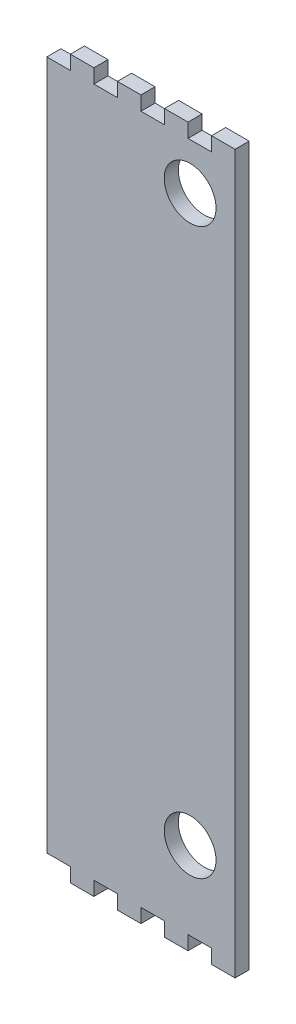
ISO-10303-21;
HEADER;
FILE_DESCRIPTION(('STEP AP214'),'2;1');
FILE_NAME('part.step','',(''),(''),'','','');
FILE_SCHEMA(('AUTOMOTIVE_DESIGN { 1 0 10303 214 1 1 1 1 }'));
ENDSEC;
DATA;
#1=APPLICATION_CONTEXT('core data for automotive mechanical design processes');
#2=APPLICATION_PROTOCOL_DEFINITION('international standard','automotive_design',2000,#1);
#3=PRODUCT_CONTEXT('',#1,'mechanical');
#4=PRODUCT('Part','Part','',(#3));
#5=PRODUCT_RELATED_PRODUCT_CATEGORY('part','',(#4));
#6=PRODUCT_DEFINITION_FORMATION('','',#4);
#7=PRODUCT_DEFINITION_CONTEXT('part definition',#1,'design');
#8=PRODUCT_DEFINITION('design','',#6,#7);
#9=PRODUCT_DEFINITION_SHAPE('','',#8);
#10=(LENGTH_UNIT() NAMED_UNIT(*) SI_UNIT(.MILLI.,.METRE.));
#11=(NAMED_UNIT(*) PLANE_ANGLE_UNIT() SI_UNIT($,.RADIAN.));
#12=(NAMED_UNIT(*) SI_UNIT($,.STERADIAN.) SOLID_ANGLE_UNIT());
#13=UNCERTAINTY_MEASURE_WITH_UNIT(LENGTH_MEASURE(1.E-05),#10,'distance_accuracy_value','');
#14=(GEOMETRIC_REPRESENTATION_CONTEXT(3) GLOBAL_UNCERTAINTY_ASSIGNED_CONTEXT((#13)) GLOBAL_UNIT_ASSIGNED_CONTEXT((#10,
#11,#12)) REPRESENTATION_CONTEXT('',''));
#15=CARTESIAN_POINT('',(0.,0.,0.));
#16=DIRECTION('',(0.,0.,1.));
#17=DIRECTION('',(1.,0.,0.));
#18=AXIS2_PLACEMENT_3D('',#15,#16,#17);
#19=CARTESIAN_POINT('',(-30.,143.,6.));
#20=DIRECTION('',(0.,-1.,0.));
#21=DIRECTION('',(0.,0.,-1.));
#22=AXIS2_PLACEMENT_3D('',#19,#20,#21);
#23=PLANE('',#22);
#24=DIRECTION('',(-1.,0.,0.));
#25=VECTOR('',#24,1.);
#26=CARTESIAN_POINT('',(-30.,143.,0.));
#27=LINE('',#26,#25);
#28=CARTESIAN_POINT('',(-30.,143.,0.));
#29=VERTEX_POINT('',#28);
#30=CARTESIAN_POINT('',(-40.0000000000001,143.,0.));
#31=VERTEX_POINT('',#30);
#32=EDGE_CURVE('E272',#29,#31,#27,.T.);
#33=ORIENTED_EDGE('',*,*,#32,.T.);
#34=DIRECTION('',(0.,0.,-1.));
#35=VECTOR('',#34,1.);
#36=CARTESIAN_POINT('',(-40.0000000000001,143.,6.));
#37=LINE('',#36,#35);
#38=CARTESIAN_POINT('',(-40.0000000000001,143.,6.));
#39=VERTEX_POINT('',#38);
#40=EDGE_CURVE('E11',#39,#31,#37,.T.);
#41=ORIENTED_EDGE('',*,*,#40,.F.);
#42=DIRECTION('',(-1.,0.,0.));
#43=VECTOR('',#42,1.);
#44=CARTESIAN_POINT('',(-30.,143.,6.));
#45=LINE('',#44,#43);
#46=CARTESIAN_POINT('',(-30.,143.,6.));
#47=VERTEX_POINT('',#46);
#48=EDGE_CURVE('E335',#47,#39,#45,.T.);
#49=ORIENTED_EDGE('',*,*,#48,.F.);
#50=DIRECTION('',(0.,0.,-1.));
#51=VECTOR('',#50,1.);
#52=CARTESIAN_POINT('',(-30.,143.,6.));
#53=LINE('',#52,#51);
#54=EDGE_CURVE('E268',#47,#29,#53,.T.);
#55=ORIENTED_EDGE('',*,*,#54,.T.);
#56=EDGE_LOOP('',(#33,#41,#49,#55));
#57=FACE_BOUND('',#56,.T.);
#58=ADVANCED_FACE('F32',(#57),#23,.F.);
#59=CARTESIAN_POINT('',(-40.0000000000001,143.,6.));
#60=DIRECTION('',(1.,0.,0.));
#61=DIRECTION('',(0.,1.,0.));
#62=AXIS2_PLACEMENT_3D('',#59,#60,#61);
#63=PLANE('',#62);
#64=DIRECTION('',(0.,-1.,0.));
#65=VECTOR('',#64,1.);
#66=CARTESIAN_POINT('',(-40.0000000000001,143.,0.));
#67=LINE('',#66,#65);
#68=CARTESIAN_POINT('',(-40.,-150.,0.));
#69=VERTEX_POINT('',#68);
#70=EDGE_CURVE('E275',#31,#69,#67,.T.);
#71=ORIENTED_EDGE('',*,*,#70,.T.);
#72=DIRECTION('',(0.,0.,-1.));
#73=VECTOR('',#72,1.);
#74=CARTESIAN_POINT('',(-40.,-150.,6.));
#75=LINE('',#74,#73);
#76=CARTESIAN_POINT('',(-40.,-150.,6.));
#77=VERTEX_POINT('',#76);
#78=EDGE_CURVE('E40',#77,#69,#75,.T.);
#79=ORIENTED_EDGE('',*,*,#78,.F.);
#80=DIRECTION('',(0.,-1.,0.));
#81=VECTOR('',#80,1.);
#82=CARTESIAN_POINT('',(-40.0000000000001,143.,6.));
#83=LINE('',#82,#81);
#84=EDGE_CURVE('E163',#39,#77,#83,.T.);
#85=ORIENTED_EDGE('',*,*,#84,.F.);
#86=ORIENTED_EDGE('',*,*,#40,.T.);
#87=EDGE_LOOP('',(#71,#79,#85,#86));
#88=FACE_BOUND('',#87,.T.);
#89=ADVANCED_FACE('F514',(#88),#63,.F.);
#90=CARTESIAN_POINT('',(-29.9999999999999,-150.,6.));
#91=DIRECTION('',(0.,1.,0.));
#92=DIRECTION('',(0.,0.,1.));
#93=AXIS2_PLACEMENT_3D('',#90,#91,#92);
#94=PLANE('',#93);
#95=DIRECTION('',(1.,0.,0.));
#96=VECTOR('',#95,1.);
#97=CARTESIAN_POINT('',(-29.9999999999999,-150.,0.));
#98=LINE('',#97,#96);
#99=CARTESIAN_POINT('',(-29.9999999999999,-150.,0.));
#100=VERTEX_POINT('',#99);
#101=EDGE_CURVE('E278',#69,#100,#98,.T.);
#102=ORIENTED_EDGE('',*,*,#101,.T.);
#103=DIRECTION('',(0.,0.,-1.));
#104=VECTOR('',#103,1.);
#105=CARTESIAN_POINT('',(-29.9999999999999,-150.,6.));
#106=LINE('',#105,#104);
#107=CARTESIAN_POINT('',(-29.9999999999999,-150.,6.));
#108=VERTEX_POINT('',#107);
#109=EDGE_CURVE('E414',#108,#100,#106,.T.);
#110=ORIENTED_EDGE('',*,*,#109,.F.);
#111=DIRECTION('',(1.,0.,0.));
#112=VECTOR('',#111,1.);
#113=CARTESIAN_POINT('',(-29.9999999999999,-150.,6.));
#114=LINE('',#113,#112);
#115=EDGE_CURVE('E422',#77,#108,#114,.T.);
#116=ORIENTED_EDGE('',*,*,#115,.F.);
#117=ORIENTED_EDGE('',*,*,#78,.T.);
#118=EDGE_LOOP('',(#102,#110,#116,#117));
#119=FACE_BOUND('',#118,.T.);
#120=ADVANCED_FACE('F420',(#119),#94,.F.);
#121=CARTESIAN_POINT('',(-29.9999999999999,-156.,6.));
#122=DIRECTION('',(1.,0.,0.));
#123=DIRECTION('',(0.,0.,-1.));
#124=AXIS2_PLACEMENT_3D('',#121,#122,#123);
#125=PLANE('',#124);
#126=DIRECTION('',(0.,-1.,0.));
#127=VECTOR('',#126,1.);
#128=CARTESIAN_POINT('',(-29.9999999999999,-156.,0.));
#129=LINE('',#128,#127);
#130=CARTESIAN_POINT('',(-29.9999999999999,-156.,0.));
#131=VERTEX_POINT('',#130);
#132=EDGE_CURVE('E280',#100,#131,#129,.T.);
#133=ORIENTED_EDGE('',*,*,#132,.T.);
#134=DIRECTION('',(0.,0.,-1.));
#135=VECTOR('',#134,1.);
#136=CARTESIAN_POINT('',(-29.9999999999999,-156.,6.));
#137=LINE('',#136,#135);
#138=CARTESIAN_POINT('',(-29.9999999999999,-156.,6.));
#139=VERTEX_POINT('',#138);
#140=EDGE_CURVE('E411',#139,#131,#137,.T.);
#141=ORIENTED_EDGE('',*,*,#140,.F.);
#142=DIRECTION('',(0.,-1.,0.));
#143=VECTOR('',#142,1.);
#144=CARTESIAN_POINT('',(-29.9999999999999,-156.,6.));
#145=LINE('',#144,#143);
#146=EDGE_CURVE('E440',#108,#139,#145,.T.);
#147=ORIENTED_EDGE('',*,*,#146,.F.);
#148=ORIENTED_EDGE('',*,*,#109,.T.);
#149=EDGE_LOOP('',(#133,#141,#147,#148));
#150=FACE_BOUND('',#149,.T.);
#151=ADVANCED_FACE('F431',(#150),#125,.F.);
#152=CARTESIAN_POINT('',(-19.9999999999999,-156.,6.));
#153=DIRECTION('',(0.,1.,0.));
#154=DIRECTION('',(0.,0.,1.));
#155=AXIS2_PLACEMENT_3D('',#152,#153,#154);
#156=PLANE('',#155);
#157=DIRECTION('',(1.,0.,0.));
#158=VECTOR('',#157,1.);
#159=CARTESIAN_POINT('',(-19.9999999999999,-156.,0.));
#160=LINE('',#159,#158);
#161=CARTESIAN_POINT('',(-19.9999999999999,-156.,0.));
#162=VERTEX_POINT('',#161);
#163=EDGE_CURVE('E282',#131,#162,#160,.T.);
#164=ORIENTED_EDGE('',*,*,#163,.T.);
#165=DIRECTION('',(0.,0.,-1.));
#166=VECTOR('',#165,1.);
#167=CARTESIAN_POINT('',(-19.9999999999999,-156.,6.));
#168=LINE('',#167,#166);
#169=CARTESIAN_POINT('',(-19.9999999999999,-156.,6.));
#170=VERTEX_POINT('',#169);
#171=EDGE_CURVE('E408',#170,#162,#168,.T.);
#172=ORIENTED_EDGE('',*,*,#171,.F.);
#173=DIRECTION('',(1.,0.,0.));
#174=VECTOR('',#173,1.);
#175=CARTESIAN_POINT('',(-19.9999999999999,-156.,6.));
#176=LINE('',#175,#174);
#177=EDGE_CURVE('E437',#139,#170,#176,.T.);
#178=ORIENTED_EDGE('',*,*,#177,.F.);
#179=ORIENTED_EDGE('',*,*,#140,.T.);
#180=EDGE_LOOP('',(#164,#172,#178,#179));
#181=FACE_BOUND('',#180,.T.);
#182=ADVANCED_FACE('F435',(#181),#156,.F.);
#183=CARTESIAN_POINT('',(-19.9999999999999,-156.,6.));
#184=DIRECTION('',(-1.,0.,0.));
#185=DIRECTION('',(0.,-1.,0.));
#186=AXIS2_PLACEMENT_3D('',#183,#184,#185);
#187=PLANE('',#186);
#188=DIRECTION('',(0.,1.,0.));
#189=VECTOR('',#188,1.);
#190=CARTESIAN_POINT('',(-19.9999999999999,-156.,0.));
#191=LINE('',#190,#189);
#192=CARTESIAN_POINT('',(-20.,-150.,0.));
#193=VERTEX_POINT('',#192);
#194=EDGE_CURVE('E284',#162,#193,#191,.T.);
#195=ORIENTED_EDGE('',*,*,#194,.T.);
#196=DIRECTION('',(0.,0.,-1.));
#197=VECTOR('',#196,1.);
#198=CARTESIAN_POINT('',(-20.,-150.,6.));
#199=LINE('',#198,#197);
#200=CARTESIAN_POINT('',(-20.,-150.,6.));
#201=VERTEX_POINT('',#200);
#202=EDGE_CURVE('E405',#201,#193,#199,.T.);
#203=ORIENTED_EDGE('',*,*,#202,.F.);
#204=DIRECTION('',(0.,1.,0.));
#205=VECTOR('',#204,1.);
#206=CARTESIAN_POINT('',(-19.9999999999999,-156.,6.));
#207=LINE('',#206,#205);
#208=EDGE_CURVE('E439',#170,#201,#207,.T.);
#209=ORIENTED_EDGE('',*,*,#208,.F.);
#210=ORIENTED_EDGE('',*,*,#171,.T.);
#211=EDGE_LOOP('',(#195,#203,#209,#210));
#212=FACE_BOUND('',#211,.T.);
#213=ADVANCED_FACE('F527',(#212),#187,.F.);
#214=CARTESIAN_POINT('',(-9.9999999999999,-150.,6.));
#215=DIRECTION('',(0.,1.,0.));
#216=DIRECTION('',(0.,0.,1.));
#217=AXIS2_PLACEMENT_3D('',#214,#215,#216);
#218=PLANE('',#217);
#219=DIRECTION('',(1.,0.,0.));
#220=VECTOR('',#219,1.);
#221=CARTESIAN_POINT('',(-9.9999999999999,-150.,0.));
#222=LINE('',#221,#220);
#223=CARTESIAN_POINT('',(-9.9999999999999,-150.,0.));
#224=VERTEX_POINT('',#223);
#225=EDGE_CURVE('E286',#193,#224,#222,.T.);
#226=ORIENTED_EDGE('',*,*,#225,.T.);
#227=DIRECTION('',(0.,0.,-1.));
#228=VECTOR('',#227,1.);
#229=CARTESIAN_POINT('',(-9.9999999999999,-150.,6.));
#230=LINE('',#229,#228);
#231=CARTESIAN_POINT('',(-9.9999999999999,-150.,6.));
#232=VERTEX_POINT('',#231);
#233=EDGE_CURVE('E402',#232,#224,#230,.T.);
#234=ORIENTED_EDGE('',*,*,#233,.F.);
#235=DIRECTION('',(1.,0.,0.));
#236=VECTOR('',#235,1.);
#237=CARTESIAN_POINT('',(-9.9999999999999,-150.,6.));
#238=LINE('',#237,#236);
#239=EDGE_CURVE('E442',#201,#232,#238,.T.);
#240=ORIENTED_EDGE('',*,*,#239,.F.);
#241=ORIENTED_EDGE('',*,*,#202,.T.);
#242=EDGE_LOOP('',(#226,#234,#240,#241));
#243=FACE_BOUND('',#242,.T.);
#244=ADVANCED_FACE('F530',(#243),#218,.F.);
#245=CARTESIAN_POINT('',(-9.9999999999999,-156.,6.));
#246=DIRECTION('',(1.,0.,0.));
#247=DIRECTION('',(0.,0.,-1.));
#248=AXIS2_PLACEMENT_3D('',#245,#246,#247);
#249=PLANE('',#248);
#250=DIRECTION('',(0.,-1.,0.));
#251=VECTOR('',#250,1.);
#252=CARTESIAN_POINT('',(-9.9999999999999,-156.,0.));
#253=LINE('',#252,#251);
#254=CARTESIAN_POINT('',(-9.9999999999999,-156.,0.));
#255=VERTEX_POINT('',#254);
#256=EDGE_CURVE('E288',#224,#255,#253,.T.);
#257=ORIENTED_EDGE('',*,*,#256,.T.);
#258=DIRECTION('',(0.,0.,-1.));
#259=VECTOR('',#258,1.);
#260=CARTESIAN_POINT('',(-9.9999999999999,-156.,6.));
#261=LINE('',#260,#259);
#262=CARTESIAN_POINT('',(-9.9999999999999,-156.,6.));
#263=VERTEX_POINT('',#262);
#264=EDGE_CURVE('E399',#263,#255,#261,.T.);
#265=ORIENTED_EDGE('',*,*,#264,.F.);
#266=DIRECTION('',(0.,-1.,0.));
#267=VECTOR('',#266,1.);
#268=CARTESIAN_POINT('',(-9.9999999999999,-156.,6.));
#269=LINE('',#268,#267);
#270=EDGE_CURVE('E448',#232,#263,#269,.T.);
#271=ORIENTED_EDGE('',*,*,#270,.F.);
#272=ORIENTED_EDGE('',*,*,#233,.T.);
#273=EDGE_LOOP('',(#257,#265,#271,#272));
#274=FACE_BOUND('',#273,.T.);
#275=ADVANCED_FACE('F534',(#274),#249,.F.);
#276=CARTESIAN_POINT('',(0.,-156.,6.));
#277=DIRECTION('',(0.,1.,0.));
#278=DIRECTION('',(0.,0.,1.));
#279=AXIS2_PLACEMENT_3D('',#276,#277,#278);
#280=PLANE('',#279);
#281=DIRECTION('',(1.,0.,0.));
#282=VECTOR('',#281,1.);
#283=CARTESIAN_POINT('',(0.,-156.,0.));
#284=LINE('',#283,#282);
#285=CARTESIAN_POINT('',(0.,-156.,0.));
#286=VERTEX_POINT('',#285);
#287=EDGE_CURVE('E290',#255,#286,#284,.T.);
#288=ORIENTED_EDGE('',*,*,#287,.T.);
#289=DIRECTION('',(0.,0.,-1.));
#290=VECTOR('',#289,1.);
#291=CARTESIAN_POINT('',(0.,-156.,6.));
#292=LINE('',#291,#290);
#293=CARTESIAN_POINT('',(0.,-156.,6.));
#294=VERTEX_POINT('',#293);
#295=EDGE_CURVE('E396',#294,#286,#292,.T.);
#296=ORIENTED_EDGE('',*,*,#295,.F.);
#297=DIRECTION('',(1.,0.,0.));
#298=VECTOR('',#297,1.);
#299=CARTESIAN_POINT('',(0.,-156.,6.));
#300=LINE('',#299,#298);
#301=EDGE_CURVE('E450',#263,#294,#300,.T.);
#302=ORIENTED_EDGE('',*,*,#301,.F.);
#303=ORIENTED_EDGE('',*,*,#264,.T.);
#304=EDGE_LOOP('',(#288,#296,#302,#303));
#305=FACE_BOUND('',#304,.T.);
#306=ADVANCED_FACE('F538',(#305),#280,.F.);
#307=CARTESIAN_POINT('',(0.,-156.,6.));
#308=DIRECTION('',(-1.,0.,0.));
#309=DIRECTION('',(0.,-1.,0.));
#310=AXIS2_PLACEMENT_3D('',#307,#308,#309);
#311=PLANE('',#310);
#312=DIRECTION('',(0.,1.,0.));
#313=VECTOR('',#312,1.);
#314=CARTESIAN_POINT('',(0.,-156.,0.));
#315=LINE('',#314,#313);
#316=CARTESIAN_POINT('',(0.,-150.,0.));
#317=VERTEX_POINT('',#316);
#318=EDGE_CURVE('E292',#286,#317,#315,.T.);
#319=ORIENTED_EDGE('',*,*,#318,.T.);
#320=DIRECTION('',(0.,0.,-1.));
#321=VECTOR('',#320,1.);
#322=CARTESIAN_POINT('',(0.,-150.,6.));
#323=LINE('',#322,#321);
#324=CARTESIAN_POINT('',(0.,-150.,6.));
#325=VERTEX_POINT('',#324);
#326=EDGE_CURVE('E393',#325,#317,#323,.T.);
#327=ORIENTED_EDGE('',*,*,#326,.F.);
#328=DIRECTION('',(0.,1.,0.));
#329=VECTOR('',#328,1.);
#330=CARTESIAN_POINT('',(0.,-156.,6.));
#331=LINE('',#330,#329);
#332=EDGE_CURVE('E452',#294,#325,#331,.T.);
#333=ORIENTED_EDGE('',*,*,#332,.F.);
#334=ORIENTED_EDGE('',*,*,#295,.T.);
#335=EDGE_LOOP('',(#319,#327,#333,#334));
#336=FACE_BOUND('',#335,.T.);
#337=ADVANCED_FACE('F542',(#336),#311,.F.);
#338=CARTESIAN_POINT('',(10.0000000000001,-150.,6.));
#339=DIRECTION('',(0.,1.,0.));
#340=DIRECTION('',(0.,0.,1.));
#341=AXIS2_PLACEMENT_3D('',#338,#339,#340);
#342=PLANE('',#341);
#343=DIRECTION('',(1.,0.,0.));
#344=VECTOR('',#343,1.);
#345=CARTESIAN_POINT('',(10.0000000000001,-150.,0.));
#346=LINE('',#345,#344);
#347=CARTESIAN_POINT('',(10.0000000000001,-150.,0.));
#348=VERTEX_POINT('',#347);
#349=EDGE_CURVE('E294',#317,#348,#346,.T.);
#350=ORIENTED_EDGE('',*,*,#349,.T.);
#351=DIRECTION('',(0.,0.,-1.));
#352=VECTOR('',#351,1.);
#353=CARTESIAN_POINT('',(10.0000000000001,-150.,6.));
#354=LINE('',#353,#352);
#355=CARTESIAN_POINT('',(10.0000000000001,-150.,6.));
#356=VERTEX_POINT('',#355);
#357=EDGE_CURVE('E390',#356,#348,#354,.T.);
#358=ORIENTED_EDGE('',*,*,#357,.F.);
#359=DIRECTION('',(1.,0.,0.));
#360=VECTOR('',#359,1.);
#361=CARTESIAN_POINT('',(10.0000000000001,-150.,6.));
#362=LINE('',#361,#360);
#363=EDGE_CURVE('E454',#325,#356,#362,.T.);
#364=ORIENTED_EDGE('',*,*,#363,.F.);
#365=ORIENTED_EDGE('',*,*,#326,.T.);
#366=EDGE_LOOP('',(#350,#358,#364,#365));
#367=FACE_BOUND('',#366,.T.);
#368=ADVANCED_FACE('F546',(#367),#342,.F.);
#369=CARTESIAN_POINT('',(10.0000000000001,-156.,6.));
#370=DIRECTION('',(1.,0.,0.));
#371=DIRECTION('',(0.,0.,-1.));
#372=AXIS2_PLACEMENT_3D('',#369,#370,#371);
#373=PLANE('',#372);
#374=DIRECTION('',(0.,-1.,0.));
#375=VECTOR('',#374,1.);
#376=CARTESIAN_POINT('',(10.0000000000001,-156.,0.));
#377=LINE('',#376,#375);
#378=CARTESIAN_POINT('',(10.0000000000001,-156.,0.));
#379=VERTEX_POINT('',#378);
#380=EDGE_CURVE('E296',#348,#379,#377,.T.);
#381=ORIENTED_EDGE('',*,*,#380,.T.);
#382=DIRECTION('',(0.,0.,-1.));
#383=VECTOR('',#382,1.);
#384=CARTESIAN_POINT('',(10.0000000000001,-156.,6.));
#385=LINE('',#384,#383);
#386=CARTESIAN_POINT('',(10.0000000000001,-156.,6.));
#387=VERTEX_POINT('',#386);
#388=EDGE_CURVE('E387',#387,#379,#385,.T.);
#389=ORIENTED_EDGE('',*,*,#388,.F.);
#390=DIRECTION('',(0.,-1.,0.));
#391=VECTOR('',#390,1.);
#392=CARTESIAN_POINT('',(10.0000000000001,-156.,6.));
#393=LINE('',#392,#391);
#394=EDGE_CURVE('E456',#356,#387,#393,.T.);
#395=ORIENTED_EDGE('',*,*,#394,.F.);
#396=ORIENTED_EDGE('',*,*,#357,.T.);
#397=EDGE_LOOP('',(#381,#389,#395,#396));
#398=FACE_BOUND('',#397,.T.);
#399=ADVANCED_FACE('F550',(#398),#373,.F.);
#400=CARTESIAN_POINT('',(20.0000000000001,-156.,6.));
#401=DIRECTION('',(0.,1.,0.));
#402=DIRECTION('',(0.,0.,1.));
#403=AXIS2_PLACEMENT_3D('',#400,#401,#402);
#404=PLANE('',#403);
#405=DIRECTION('',(1.,0.,0.));
#406=VECTOR('',#405,1.);
#407=CARTESIAN_POINT('',(20.0000000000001,-156.,0.));
#408=LINE('',#407,#406);
#409=CARTESIAN_POINT('',(20.0000000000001,-156.,0.));
#410=VERTEX_POINT('',#409);
#411=EDGE_CURVE('E298',#379,#410,#408,.T.);
#412=ORIENTED_EDGE('',*,*,#411,.T.);
#413=DIRECTION('',(0.,0.,-1.));
#414=VECTOR('',#413,1.);
#415=CARTESIAN_POINT('',(20.0000000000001,-156.,6.));
#416=LINE('',#415,#414);
#417=CARTESIAN_POINT('',(20.0000000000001,-156.,6.));
#418=VERTEX_POINT('',#417);
#419=EDGE_CURVE('E384',#418,#410,#416,.T.);
#420=ORIENTED_EDGE('',*,*,#419,.F.);
#421=DIRECTION('',(1.,0.,0.));
#422=VECTOR('',#421,1.);
#423=CARTESIAN_POINT('',(20.0000000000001,-156.,6.));
#424=LINE('',#423,#422);
#425=EDGE_CURVE('E458',#387,#418,#424,.T.);
#426=ORIENTED_EDGE('',*,*,#425,.F.);
#427=ORIENTED_EDGE('',*,*,#388,.T.);
#428=EDGE_LOOP('',(#412,#420,#426,#427));
#429=FACE_BOUND('',#428,.T.);
#430=ADVANCED_FACE('F554',(#429),#404,.F.);
#431=CARTESIAN_POINT('',(20.0000000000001,-156.,6.));
#432=DIRECTION('',(-1.,0.,0.));
#433=DIRECTION('',(0.,-1.,0.));
#434=AXIS2_PLACEMENT_3D('',#431,#432,#433);
#435=PLANE('',#434);
#436=DIRECTION('',(0.,1.,0.));
#437=VECTOR('',#436,1.);
#438=CARTESIAN_POINT('',(20.0000000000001,-156.,0.));
#439=LINE('',#438,#437);
#440=CARTESIAN_POINT('',(20.,-150.,0.));
#441=VERTEX_POINT('',#440);
#442=EDGE_CURVE('E300',#410,#441,#439,.T.);
#443=ORIENTED_EDGE('',*,*,#442,.T.);
#444=DIRECTION('',(0.,0.,-1.));
#445=VECTOR('',#444,1.);
#446=CARTESIAN_POINT('',(20.,-150.,6.));
#447=LINE('',#446,#445);
#448=CARTESIAN_POINT('',(20.,-150.,6.));
#449=VERTEX_POINT('',#448);
#450=EDGE_CURVE('E381',#449,#441,#447,.T.);
#451=ORIENTED_EDGE('',*,*,#450,.F.);
#452=DIRECTION('',(0.,1.,0.));
#453=VECTOR('',#452,1.);
#454=CARTESIAN_POINT('',(20.0000000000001,-156.,6.));
#455=LINE('',#454,#453);
#456=EDGE_CURVE('E460',#418,#449,#455,.T.);
#457=ORIENTED_EDGE('',*,*,#456,.F.);
#458=ORIENTED_EDGE('',*,*,#419,.T.);
#459=EDGE_LOOP('',(#443,#451,#457,#458));
#460=FACE_BOUND('',#459,.T.);
#461=ADVANCED_FACE('F558',(#460),#435,.F.);
#462=CARTESIAN_POINT('',(30.0000000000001,-150.,6.));
#463=DIRECTION('',(0.,1.,0.));
#464=DIRECTION('',(0.,0.,1.));
#465=AXIS2_PLACEMENT_3D('',#462,#463,#464);
#466=PLANE('',#465);
#467=DIRECTION('',(1.,0.,0.));
#468=VECTOR('',#467,1.);
#469=CARTESIAN_POINT('',(30.0000000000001,-150.,0.));
#470=LINE('',#469,#468);
#471=CARTESIAN_POINT('',(30.0000000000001,-150.,0.));
#472=VERTEX_POINT('',#471);
#473=EDGE_CURVE('E302',#441,#472,#470,.T.);
#474=ORIENTED_EDGE('',*,*,#473,.T.);
#475=DIRECTION('',(0.,0.,-1.));
#476=VECTOR('',#475,1.);
#477=CARTESIAN_POINT('',(30.0000000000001,-150.,6.));
#478=LINE('',#477,#476);
#479=CARTESIAN_POINT('',(30.0000000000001,-150.,6.));
#480=VERTEX_POINT('',#479);
#481=EDGE_CURVE('E378',#480,#472,#478,.T.);
#482=ORIENTED_EDGE('',*,*,#481,.F.);
#483=DIRECTION('',(1.,0.,0.));
#484=VECTOR('',#483,1.);
#485=CARTESIAN_POINT('',(30.0000000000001,-150.,6.));
#486=LINE('',#485,#484);
#487=EDGE_CURVE('E462',#449,#480,#486,.T.);
#488=ORIENTED_EDGE('',*,*,#487,.F.);
#489=ORIENTED_EDGE('',*,*,#450,.T.);
#490=EDGE_LOOP('',(#474,#482,#488,#489));
#491=FACE_BOUND('',#490,.T.);
#492=ADVANCED_FACE('F562',(#491),#466,.F.);
#493=CARTESIAN_POINT('',(30.0000000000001,-156.,6.));
#494=DIRECTION('',(1.,0.,0.));
#495=DIRECTION('',(0.,0.,-1.));
#496=AXIS2_PLACEMENT_3D('',#493,#494,#495);
#497=PLANE('',#496);
#498=DIRECTION('',(0.,-1.,0.));
#499=VECTOR('',#498,1.);
#500=CARTESIAN_POINT('',(30.0000000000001,-156.,0.));
#501=LINE('',#500,#499);
#502=CARTESIAN_POINT('',(30.0000000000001,-156.,0.));
#503=VERTEX_POINT('',#502);
#504=EDGE_CURVE('E304',#472,#503,#501,.T.);
#505=ORIENTED_EDGE('',*,*,#504,.T.);
#506=DIRECTION('',(0.,0.,-1.));
#507=VECTOR('',#506,1.);
#508=CARTESIAN_POINT('',(30.0000000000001,-156.,6.));
#509=LINE('',#508,#507);
#510=CARTESIAN_POINT('',(30.0000000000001,-156.,6.));
#511=VERTEX_POINT('',#510);
#512=EDGE_CURVE('E375',#511,#503,#509,.T.);
#513=ORIENTED_EDGE('',*,*,#512,.F.);
#514=DIRECTION('',(0.,-1.,0.));
#515=VECTOR('',#514,1.);
#516=CARTESIAN_POINT('',(30.0000000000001,-156.,6.));
#517=LINE('',#516,#515);
#518=EDGE_CURVE('E464',#480,#511,#517,.T.);
#519=ORIENTED_EDGE('',*,*,#518,.F.);
#520=ORIENTED_EDGE('',*,*,#481,.T.);
#521=EDGE_LOOP('',(#505,#513,#519,#520));
#522=FACE_BOUND('',#521,.T.);
#523=ADVANCED_FACE('F566',(#522),#497,.F.);
#524=CARTESIAN_POINT('',(40.0000000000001,-156.,6.));
#525=DIRECTION('',(0.,1.,0.));
#526=DIRECTION('',(0.,0.,1.));
#527=AXIS2_PLACEMENT_3D('',#524,#525,#526);
#528=PLANE('',#527);
#529=DIRECTION('',(1.,0.,0.));
#530=VECTOR('',#529,1.);
#531=CARTESIAN_POINT('',(40.0000000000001,-156.,0.));
#532=LINE('',#531,#530);
#533=CARTESIAN_POINT('',(40.0000000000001,-156.,0.));
#534=VERTEX_POINT('',#533);
#535=EDGE_CURVE('E306',#503,#534,#532,.T.);
#536=ORIENTED_EDGE('',*,*,#535,.T.);
#537=DIRECTION('',(0.,0.,-1.));
#538=VECTOR('',#537,1.);
#539=CARTESIAN_POINT('',(40.0000000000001,-156.,6.));
#540=LINE('',#539,#538);
#541=CARTESIAN_POINT('',(40.0000000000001,-156.,6.));
#542=VERTEX_POINT('',#541);
#543=EDGE_CURVE('E372',#542,#534,#540,.T.);
#544=ORIENTED_EDGE('',*,*,#543,.F.);
#545=DIRECTION('',(1.,0.,0.));
#546=VECTOR('',#545,1.);
#547=CARTESIAN_POINT('',(40.0000000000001,-156.,6.));
#548=LINE('',#547,#546);
#549=EDGE_CURVE('E466',#511,#542,#548,.T.);
#550=ORIENTED_EDGE('',*,*,#549,.F.);
#551=ORIENTED_EDGE('',*,*,#512,.T.);
#552=EDGE_LOOP('',(#536,#544,#550,#551));
#553=FACE_BOUND('',#552,.T.);
#554=ADVANCED_FACE('F570',(#553),#528,.F.);
#555=CARTESIAN_POINT('',(40.0000000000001,149.,6.));
#556=DIRECTION('',(-1.,0.,0.));
#557=DIRECTION('',(0.,0.,1.));
#558=AXIS2_PLACEMENT_3D('',#555,#556,#557);
#559=PLANE('',#558);
#560=DIRECTION('',(0.,1.,0.));
#561=VECTOR('',#560,1.);
#562=CARTESIAN_POINT('',(40.0000000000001,149.,0.));
#563=LINE('',#562,#561);
#564=CARTESIAN_POINT('',(40.0000000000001,149.,0.));
#565=VERTEX_POINT('',#564);
#566=EDGE_CURVE('E308',#534,#565,#563,.T.);
#567=ORIENTED_EDGE('',*,*,#566,.T.);
#568=DIRECTION('',(0.,0.,-1.));
#569=VECTOR('',#568,1.);
#570=CARTESIAN_POINT('',(40.0000000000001,149.,6.));
#571=LINE('',#570,#569);
#572=CARTESIAN_POINT('',(40.0000000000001,149.,6.));
#573=VERTEX_POINT('',#572);
#574=EDGE_CURVE('E369',#573,#565,#571,.T.);
#575=ORIENTED_EDGE('',*,*,#574,.F.);
#576=DIRECTION('',(0.,1.,0.));
#577=VECTOR('',#576,1.);
#578=CARTESIAN_POINT('',(40.0000000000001,149.,6.));
#579=LINE('',#578,#577);
#580=EDGE_CURVE('E468',#542,#573,#579,.T.);
#581=ORIENTED_EDGE('',*,*,#580,.F.);
#582=ORIENTED_EDGE('',*,*,#543,.T.);
#583=EDGE_LOOP('',(#567,#575,#581,#582));
#584=FACE_BOUND('',#583,.T.);
#585=ADVANCED_FACE('F574',(#584),#559,.F.);
#586=CARTESIAN_POINT('',(40.0000000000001,149.,6.));
#587=DIRECTION('',(0.,-1.,0.));
#588=DIRECTION('',(0.,0.,-1.));
#589=AXIS2_PLACEMENT_3D('',#586,#587,#588);
#590=PLANE('',#589);
#591=DIRECTION('',(-1.,0.,0.));
#592=VECTOR('',#591,1.);
#593=CARTESIAN_POINT('',(40.0000000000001,149.,0.));
#594=LINE('',#593,#592);
#595=CARTESIAN_POINT('',(30.0000000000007,149.,0.));
#596=VERTEX_POINT('',#595);
#597=EDGE_CURVE('E310',#565,#596,#594,.T.);
#598=ORIENTED_EDGE('',*,*,#597,.T.);
#599=DIRECTION('',(0.,0.,-1.));
#600=VECTOR('',#599,1.);
#601=CARTESIAN_POINT('',(30.0000000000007,149.,6.));
#602=LINE('',#601,#600);
#603=CARTESIAN_POINT('',(30.0000000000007,149.,6.));
#604=VERTEX_POINT('',#603);
#605=EDGE_CURVE('E366',#604,#596,#602,.T.);
#606=ORIENTED_EDGE('',*,*,#605,.F.);
#607=DIRECTION('',(-1.,0.,0.));
#608=VECTOR('',#607,1.);
#609=CARTESIAN_POINT('',(40.0000000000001,149.,6.));
#610=LINE('',#609,#608);
#611=EDGE_CURVE('E470',#573,#604,#610,.T.);
#612=ORIENTED_EDGE('',*,*,#611,.F.);
#613=ORIENTED_EDGE('',*,*,#574,.T.);
#614=EDGE_LOOP('',(#598,#606,#612,#613));
#615=FACE_BOUND('',#614,.T.);
#616=ADVANCED_FACE('F578',(#615),#590,.F.);
#617=CARTESIAN_POINT('',(30.0000000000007,149.,6.));
#618=DIRECTION('',(1.,0.,0.));
#619=DIRECTION('',(0.,0.,-1.));
#620=AXIS2_PLACEMENT_3D('',#617,#618,#619);
#621=PLANE('',#620);
#622=DIRECTION('',(0.,-1.,0.));
#623=VECTOR('',#622,1.);
#624=CARTESIAN_POINT('',(30.0000000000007,149.,0.));
#625=LINE('',#624,#623);
#626=CARTESIAN_POINT('',(30.0000000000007,143.,0.));
#627=VERTEX_POINT('',#626);
#628=EDGE_CURVE('E312',#596,#627,#625,.T.);
#629=ORIENTED_EDGE('',*,*,#628,.T.);
#630=DIRECTION('',(0.,0.,-1.));
#631=VECTOR('',#630,1.);
#632=CARTESIAN_POINT('',(30.0000000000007,143.,6.));
#633=LINE('',#632,#631);
#634=CARTESIAN_POINT('',(30.0000000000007,143.,6.));
#635=VERTEX_POINT('',#634);
#636=EDGE_CURVE('E363',#635,#627,#633,.T.);
#637=ORIENTED_EDGE('',*,*,#636,.F.);
#638=DIRECTION('',(0.,-1.,0.));
#639=VECTOR('',#638,1.);
#640=CARTESIAN_POINT('',(30.0000000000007,149.,6.));
#641=LINE('',#640,#639);
#642=EDGE_CURVE('E472',#604,#635,#641,.T.);
#643=ORIENTED_EDGE('',*,*,#642,.F.);
#644=ORIENTED_EDGE('',*,*,#605,.T.);
#645=EDGE_LOOP('',(#629,#637,#643,#644));
#646=FACE_BOUND('',#645,.T.);
#647=ADVANCED_FACE('F582',(#646),#621,.F.);
#648=CARTESIAN_POINT('',(30.0000000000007,143.,6.));
#649=DIRECTION('',(0.,-1.,0.));
#650=DIRECTION('',(0.,0.,-1.));
#651=AXIS2_PLACEMENT_3D('',#648,#649,#650);
#652=PLANE('',#651);
#653=DIRECTION('',(-1.,0.,0.));
#654=VECTOR('',#653,1.);
#655=CARTESIAN_POINT('',(30.0000000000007,143.,0.));
#656=LINE('',#655,#654);
#657=CARTESIAN_POINT('',(20.0000000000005,143.,0.));
#658=VERTEX_POINT('',#657);
#659=EDGE_CURVE('E314',#627,#658,#656,.T.);
#660=ORIENTED_EDGE('',*,*,#659,.T.);
#661=DIRECTION('',(0.,0.,-1.));
#662=VECTOR('',#661,1.);
#663=CARTESIAN_POINT('',(20.0000000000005,143.,6.));
#664=LINE('',#663,#662);
#665=CARTESIAN_POINT('',(20.0000000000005,143.,6.));
#666=VERTEX_POINT('',#665);
#667=EDGE_CURVE('E360',#666,#658,#664,.T.);
#668=ORIENTED_EDGE('',*,*,#667,.F.);
#669=DIRECTION('',(-1.,0.,0.));
#670=VECTOR('',#669,1.);
#671=CARTESIAN_POINT('',(30.0000000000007,143.,6.));
#672=LINE('',#671,#670);
#673=EDGE_CURVE('E474',#635,#666,#672,.T.);
#674=ORIENTED_EDGE('',*,*,#673,.F.);
#675=ORIENTED_EDGE('',*,*,#636,.T.);
#676=EDGE_LOOP('',(#660,#668,#674,#675));
#677=FACE_BOUND('',#676,.T.);
#678=ADVANCED_FACE('F586',(#677),#652,.F.);
#679=CARTESIAN_POINT('',(20.0000000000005,149.,6.));
#680=DIRECTION('',(-1.,0.,0.));
#681=DIRECTION('',(0.,0.,1.));
#682=AXIS2_PLACEMENT_3D('',#679,#680,#681);
#683=PLANE('',#682);
#684=DIRECTION('',(0.,1.,0.));
#685=VECTOR('',#684,1.);
#686=CARTESIAN_POINT('',(20.0000000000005,149.,0.));
#687=LINE('',#686,#685);
#688=CARTESIAN_POINT('',(20.0000000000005,149.,0.));
#689=VERTEX_POINT('',#688);
#690=EDGE_CURVE('E316',#658,#689,#687,.T.);
#691=ORIENTED_EDGE('',*,*,#690,.T.);
#692=DIRECTION('',(0.,0.,-1.));
#693=VECTOR('',#692,1.);
#694=CARTESIAN_POINT('',(20.0000000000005,149.,6.));
#695=LINE('',#694,#693);
#696=CARTESIAN_POINT('',(20.0000000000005,149.,6.));
#697=VERTEX_POINT('',#696);
#698=EDGE_CURVE('E357',#697,#689,#695,.T.);
#699=ORIENTED_EDGE('',*,*,#698,.F.);
#700=DIRECTION('',(0.,1.,0.));
#701=VECTOR('',#700,1.);
#702=CARTESIAN_POINT('',(20.0000000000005,149.,6.));
#703=LINE('',#702,#701);
#704=EDGE_CURVE('E476',#666,#697,#703,.T.);
#705=ORIENTED_EDGE('',*,*,#704,.F.);
#706=ORIENTED_EDGE('',*,*,#667,.T.);
#707=EDGE_LOOP('',(#691,#699,#705,#706));
#708=FACE_BOUND('',#707,.T.);
#709=ADVANCED_FACE('F590',(#708),#683,.F.);
#710=CARTESIAN_POINT('',(20.0000000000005,149.,6.));
#711=DIRECTION('',(0.,-1.,0.));
#712=DIRECTION('',(0.,0.,-1.));
#713=AXIS2_PLACEMENT_3D('',#710,#711,#712);
#714=PLANE('',#713);
#715=DIRECTION('',(-1.,0.,0.));
#716=VECTOR('',#715,1.);
#717=CARTESIAN_POINT('',(20.0000000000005,149.,0.));
#718=LINE('',#717,#716);
#719=CARTESIAN_POINT('',(10.0000000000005,149.,0.));
#720=VERTEX_POINT('',#719);
#721=EDGE_CURVE('E318',#689,#720,#718,.T.);
#722=ORIENTED_EDGE('',*,*,#721,.T.);
#723=DIRECTION('',(0.,0.,-1.));
#724=VECTOR('',#723,1.);
#725=CARTESIAN_POINT('',(10.0000000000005,149.,6.));
#726=LINE('',#725,#724);
#727=CARTESIAN_POINT('',(10.0000000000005,149.,6.));
#728=VERTEX_POINT('',#727);
#729=EDGE_CURVE('E354',#728,#720,#726,.T.);
#730=ORIENTED_EDGE('',*,*,#729,.F.);
#731=DIRECTION('',(-1.,0.,0.));
#732=VECTOR('',#731,1.);
#733=CARTESIAN_POINT('',(20.0000000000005,149.,6.));
#734=LINE('',#733,#732);
#735=EDGE_CURVE('E478',#697,#728,#734,.T.);
#736=ORIENTED_EDGE('',*,*,#735,.F.);
#737=ORIENTED_EDGE('',*,*,#698,.T.);
#738=EDGE_LOOP('',(#722,#730,#736,#737));
#739=FACE_BOUND('',#738,.T.);
#740=ADVANCED_FACE('F594',(#739),#714,.F.);
#741=CARTESIAN_POINT('',(10.0000000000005,149.,6.));
#742=DIRECTION('',(1.,0.,0.));
#743=DIRECTION('',(0.,0.,-1.));
#744=AXIS2_PLACEMENT_3D('',#741,#742,#743);
#745=PLANE('',#744);
#746=DIRECTION('',(0.,-1.,0.));
#747=VECTOR('',#746,1.);
#748=CARTESIAN_POINT('',(10.0000000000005,149.,0.));
#749=LINE('',#748,#747);
#750=CARTESIAN_POINT('',(10.0000000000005,143.,0.));
#751=VERTEX_POINT('',#750);
#752=EDGE_CURVE('E320',#720,#751,#749,.T.);
#753=ORIENTED_EDGE('',*,*,#752,.T.);
#754=DIRECTION('',(0.,0.,-1.));
#755=VECTOR('',#754,1.);
#756=CARTESIAN_POINT('',(10.0000000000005,143.,6.));
#757=LINE('',#756,#755);
#758=CARTESIAN_POINT('',(10.0000000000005,143.,6.));
#759=VERTEX_POINT('',#758);
#760=EDGE_CURVE('E351',#759,#751,#757,.T.);
#761=ORIENTED_EDGE('',*,*,#760,.F.);
#762=DIRECTION('',(0.,-1.,0.));
#763=VECTOR('',#762,1.);
#764=CARTESIAN_POINT('',(10.0000000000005,149.,6.));
#765=LINE('',#764,#763);
#766=EDGE_CURVE('E480',#728,#759,#765,.T.);
#767=ORIENTED_EDGE('',*,*,#766,.F.);
#768=ORIENTED_EDGE('',*,*,#729,.T.);
#769=EDGE_LOOP('',(#753,#761,#767,#768));
#770=FACE_BOUND('',#769,.T.);
#771=ADVANCED_FACE('F598',(#770),#745,.F.);
#772=CARTESIAN_POINT('',(10.0000000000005,143.,6.));
#773=DIRECTION('',(0.,-1.,0.));
#774=DIRECTION('',(0.,0.,-1.));
#775=AXIS2_PLACEMENT_3D('',#772,#773,#774);
#776=PLANE('',#775);
#777=DIRECTION('',(-1.,0.,0.));
#778=VECTOR('',#777,1.);
#779=CARTESIAN_POINT('',(10.0000000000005,143.,0.));
#780=LINE('',#779,#778);
#781=CARTESIAN_POINT('',(2.35922392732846E-13,143.,0.));
#782=VERTEX_POINT('',#781);
#783=EDGE_CURVE('E322',#751,#782,#780,.T.);
#784=ORIENTED_EDGE('',*,*,#783,.T.);
#785=DIRECTION('',(0.,0.,-1.));
#786=VECTOR('',#785,1.);
#787=CARTESIAN_POINT('',(2.35922392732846E-13,143.,6.));
#788=LINE('',#787,#786);
#789=CARTESIAN_POINT('',(2.35922392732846E-13,143.,6.));
#790=VERTEX_POINT('',#789);
#791=EDGE_CURVE('E348',#790,#782,#788,.T.);
#792=ORIENTED_EDGE('',*,*,#791,.F.);
#793=DIRECTION('',(-1.,0.,0.));
#794=VECTOR('',#793,1.);
#795=CARTESIAN_POINT('',(10.0000000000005,143.,6.));
#796=LINE('',#795,#794);
#797=EDGE_CURVE('E482',#759,#790,#796,.T.);
#798=ORIENTED_EDGE('',*,*,#797,.F.);
#799=ORIENTED_EDGE('',*,*,#760,.T.);
#800=EDGE_LOOP('',(#784,#792,#798,#799));
#801=FACE_BOUND('',#800,.T.);
#802=ADVANCED_FACE('F602',(#801),#776,.F.);
#803=CARTESIAN_POINT('',(2.35922392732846E-13,149.,6.));
#804=DIRECTION('',(-1.,0.,0.));
#805=DIRECTION('',(0.,0.,1.));
#806=AXIS2_PLACEMENT_3D('',#803,#804,#805);
#807=PLANE('',#806);
#808=DIRECTION('',(0.,1.,0.));
#809=VECTOR('',#808,1.);
#810=CARTESIAN_POINT('',(2.35922392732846E-13,149.,0.));
#811=LINE('',#810,#809);
#812=CARTESIAN_POINT('',(2.35922392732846E-13,149.,0.));
#813=VERTEX_POINT('',#812);
#814=EDGE_CURVE('E324',#782,#813,#811,.T.);
#815=ORIENTED_EDGE('',*,*,#814,.T.);
#816=DIRECTION('',(0.,0.,-1.));
#817=VECTOR('',#816,1.);
#818=CARTESIAN_POINT('',(2.35922392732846E-13,149.,6.));
#819=LINE('',#818,#817);
#820=CARTESIAN_POINT('',(2.35922392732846E-13,149.,6.));
#821=VERTEX_POINT('',#820);
#822=EDGE_CURVE('E345',#821,#813,#819,.T.);
#823=ORIENTED_EDGE('',*,*,#822,.F.);
#824=DIRECTION('',(0.,1.,0.));
#825=VECTOR('',#824,1.);
#826=CARTESIAN_POINT('',(2.35922392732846E-13,149.,6.));
#827=LINE('',#826,#825);
#828=EDGE_CURVE('E484',#790,#821,#827,.T.);
#829=ORIENTED_EDGE('',*,*,#828,.F.);
#830=ORIENTED_EDGE('',*,*,#791,.T.);
#831=EDGE_LOOP('',(#815,#823,#829,#830));
#832=FACE_BOUND('',#831,.T.);
#833=ADVANCED_FACE('F606',(#832),#807,.F.);
#834=CARTESIAN_POINT('',(2.35922392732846E-13,149.,6.));
#835=DIRECTION('',(0.,-1.,0.));
#836=DIRECTION('',(0.,0.,-1.));
#837=AXIS2_PLACEMENT_3D('',#834,#835,#836);
#838=PLANE('',#837);
#839=DIRECTION('',(-1.,0.,0.));
#840=VECTOR('',#839,1.);
#841=CARTESIAN_POINT('',(2.35922392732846E-13,149.,0.));
#842=LINE('',#841,#840);
#843=CARTESIAN_POINT('',(-9.99999999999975,149.,0.));
#844=VERTEX_POINT('',#843);
#845=EDGE_CURVE('E326',#813,#844,#842,.T.);
#846=ORIENTED_EDGE('',*,*,#845,.T.);
#847=DIRECTION('',(0.,0.,-1.));
#848=VECTOR('',#847,1.);
#849=CARTESIAN_POINT('',(-9.99999999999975,149.,6.));
#850=LINE('',#849,#848);
#851=CARTESIAN_POINT('',(-9.99999999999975,149.,6.));
#852=VERTEX_POINT('',#851);
#853=EDGE_CURVE('E342',#852,#844,#850,.T.);
#854=ORIENTED_EDGE('',*,*,#853,.F.);
#855=DIRECTION('',(-1.,0.,0.));
#856=VECTOR('',#855,1.);
#857=CARTESIAN_POINT('',(2.35922392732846E-13,149.,6.));
#858=LINE('',#857,#856);
#859=EDGE_CURVE('E486',#821,#852,#858,.T.);
#860=ORIENTED_EDGE('',*,*,#859,.F.);
#861=ORIENTED_EDGE('',*,*,#822,.T.);
#862=EDGE_LOOP('',(#846,#854,#860,#861));
#863=FACE_BOUND('',#862,.T.);
#864=ADVANCED_FACE('F610',(#863),#838,.F.);
#865=CARTESIAN_POINT('',(-9.99999999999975,149.,6.));
#866=DIRECTION('',(1.,0.,0.));
#867=DIRECTION('',(0.,0.,-1.));
#868=AXIS2_PLACEMENT_3D('',#865,#866,#867);
#869=PLANE('',#868);
#870=DIRECTION('',(0.,-1.,0.));
#871=VECTOR('',#870,1.);
#872=CARTESIAN_POINT('',(-9.99999999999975,149.,0.));
#873=LINE('',#872,#871);
#874=CARTESIAN_POINT('',(-9.99999999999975,143.,0.));
#875=VERTEX_POINT('',#874);
#876=EDGE_CURVE('E328',#844,#875,#873,.T.);
#877=ORIENTED_EDGE('',*,*,#876,.T.);
#878=DIRECTION('',(0.,0.,-1.));
#879=VECTOR('',#878,1.);
#880=CARTESIAN_POINT('',(-9.99999999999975,143.,6.));
#881=LINE('',#880,#879);
#882=CARTESIAN_POINT('',(-9.99999999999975,143.,6.));
#883=VERTEX_POINT('',#882);
#884=EDGE_CURVE('E339',#883,#875,#881,.T.);
#885=ORIENTED_EDGE('',*,*,#884,.F.);
#886=DIRECTION('',(0.,-1.,0.));
#887=VECTOR('',#886,1.);
#888=CARTESIAN_POINT('',(-9.99999999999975,149.,6.));
#889=LINE('',#888,#887);
#890=EDGE_CURVE('E488',#852,#883,#889,.T.);
#891=ORIENTED_EDGE('',*,*,#890,.F.);
#892=ORIENTED_EDGE('',*,*,#853,.T.);
#893=EDGE_LOOP('',(#877,#885,#891,#892));
#894=FACE_BOUND('',#893,.T.);
#895=ADVANCED_FACE('F494',(#894),#869,.F.);
#896=CARTESIAN_POINT('',(-9.99999999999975,143.,6.));
#897=DIRECTION('',(0.,-1.,0.));
#898=DIRECTION('',(0.,0.,-1.));
#899=AXIS2_PLACEMENT_3D('',#896,#897,#898);
#900=PLANE('',#899);
#901=DIRECTION('',(-1.,0.,0.));
#902=VECTOR('',#901,1.);
#903=CARTESIAN_POINT('',(-9.99999999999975,143.,0.));
#904=LINE('',#903,#902);
#905=CARTESIAN_POINT('',(-20.,143.,0.));
#906=VERTEX_POINT('',#905);
#907=EDGE_CURVE('E330',#875,#906,#904,.T.);
#908=ORIENTED_EDGE('',*,*,#907,.T.);
#909=DIRECTION('',(0.,0.,-1.));
#910=VECTOR('',#909,1.);
#911=CARTESIAN_POINT('',(-20.,143.,6.));
#912=LINE('',#911,#910);
#913=CARTESIAN_POINT('',(-20.,143.,6.));
#914=VERTEX_POINT('',#913);
#915=EDGE_CURVE('E263',#914,#906,#912,.T.);
#916=ORIENTED_EDGE('',*,*,#915,.F.);
#917=DIRECTION('',(-1.,0.,0.));
#918=VECTOR('',#917,1.);
#919=CARTESIAN_POINT('',(-9.99999999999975,143.,6.));
#920=LINE('',#919,#918);
#921=EDGE_CURVE('E254',#883,#914,#920,.T.);
#922=ORIENTED_EDGE('',*,*,#921,.F.);
#923=ORIENTED_EDGE('',*,*,#884,.T.);
#924=EDGE_LOOP('',(#908,#916,#922,#923));
#925=FACE_BOUND('',#924,.T.);
#926=ADVANCED_FACE('F498',(#925),#900,.F.);
#927=CARTESIAN_POINT('',(-20.,149.,6.));
#928=DIRECTION('',(-1.,0.,0.));
#929=DIRECTION('',(0.,0.,1.));
#930=AXIS2_PLACEMENT_3D('',#927,#928,#929);
#931=PLANE('',#930);
#932=DIRECTION('',(0.,1.,0.));
#933=VECTOR('',#932,1.);
#934=CARTESIAN_POINT('',(-20.,149.,0.));
#935=LINE('',#934,#933);
#936=CARTESIAN_POINT('',(-20.,149.,0.));
#937=VERTEX_POINT('',#936);
#938=EDGE_CURVE('E262',#906,#937,#935,.T.);
#939=ORIENTED_EDGE('',*,*,#938,.T.);
#940=DIRECTION('',(0.,0.,-1.));
#941=VECTOR('',#940,1.);
#942=CARTESIAN_POINT('',(-20.,149.,6.));
#943=LINE('',#942,#941);
#944=CARTESIAN_POINT('',(-20.,149.,6.));
#945=VERTEX_POINT('',#944);
#946=EDGE_CURVE('E259',#945,#937,#943,.T.);
#947=ORIENTED_EDGE('',*,*,#946,.F.);
#948=DIRECTION('',(0.,1.,0.));
#949=VECTOR('',#948,1.);
#950=CARTESIAN_POINT('',(-20.,149.,6.));
#951=LINE('',#950,#949);
#952=EDGE_CURVE('E248',#914,#945,#951,.T.);
#953=ORIENTED_EDGE('',*,*,#952,.F.);
#954=ORIENTED_EDGE('',*,*,#915,.T.);
#955=EDGE_LOOP('',(#939,#947,#953,#954));
#956=FACE_BOUND('',#955,.T.);
#957=ADVANCED_FACE('F260',(#956),#931,.F.);
#958=CARTESIAN_POINT('',(-20.,149.,6.));
#959=DIRECTION('',(0.,-1.,0.));
#960=DIRECTION('',(0.,0.,-1.));
#961=AXIS2_PLACEMENT_3D('',#958,#959,#960);
#962=PLANE('',#961);
#963=DIRECTION('',(-1.,0.,0.));
#964=VECTOR('',#963,1.);
#965=CARTESIAN_POINT('',(-20.,149.,0.));
#966=LINE('',#965,#964);
#967=CARTESIAN_POINT('',(-30.,149.,0.));
#968=VERTEX_POINT('',#967);
#969=EDGE_CURVE('E149',#937,#968,#966,.T.);
#970=ORIENTED_EDGE('',*,*,#969,.T.);
#971=DIRECTION('',(0.,0.,-1.));
#972=VECTOR('',#971,1.);
#973=CARTESIAN_POINT('',(-30.,149.,6.));
#974=LINE('',#973,#972);
#975=CARTESIAN_POINT('',(-30.,149.,6.));
#976=VERTEX_POINT('',#975);
#977=EDGE_CURVE('E264',#976,#968,#974,.T.);
#978=ORIENTED_EDGE('',*,*,#977,.F.);
#979=DIRECTION('',(-1.,0.,0.));
#980=VECTOR('',#979,1.);
#981=CARTESIAN_POINT('',(-20.,149.,6.));
#982=LINE('',#981,#980);
#983=EDGE_CURVE('E252',#945,#976,#982,.T.);
#984=ORIENTED_EDGE('',*,*,#983,.F.);
#985=ORIENTED_EDGE('',*,*,#946,.T.);
#986=EDGE_LOOP('',(#970,#978,#984,#985));
#987=FACE_BOUND('',#986,.T.);
#988=ADVANCED_FACE('F266',(#987),#962,.F.);
#989=CARTESIAN_POINT('',(-30.,149.,6.));
#990=DIRECTION('',(1.,0.,0.));
#991=DIRECTION('',(0.,0.,-1.));
#992=AXIS2_PLACEMENT_3D('',#989,#990,#991);
#993=PLANE('',#992);
#994=DIRECTION('',(0.,-1.,0.));
#995=VECTOR('',#994,1.);
#996=CARTESIAN_POINT('',(-30.,149.,0.));
#997=LINE('',#996,#995);
#998=EDGE_CURVE('E155',#968,#29,#997,.T.);
#999=ORIENTED_EDGE('',*,*,#998,.T.);
#1000=ORIENTED_EDGE('',*,*,#54,.F.);
#1001=DIRECTION('',(0.,-1.,0.));
#1002=VECTOR('',#1001,1.);
#1003=CARTESIAN_POINT('',(-30.,149.,6.));
#1004=LINE('',#1003,#1002);
#1005=EDGE_CURVE('E48',#976,#47,#1004,.T.);
#1006=ORIENTED_EDGE('',*,*,#1005,.F.);
#1007=ORIENTED_EDGE('',*,*,#977,.T.);
#1008=EDGE_LOOP('',(#999,#1000,#1006,#1007));
#1009=FACE_BOUND('',#1008,.T.);
#1010=ADVANCED_FACE('F502',(#1009),#993,.F.);
#1011=CARTESIAN_POINT('',(0.,0.,6.));
#1012=DIRECTION('',(0.,0.,1.));
#1013=DIRECTION('',(1.,0.,0.));
#1014=AXIS2_PLACEMENT_3D('',#1011,#1012,#1013);
#1015=PLANE('',#1014);
#1016=CARTESIAN_POINT('',(20.8937476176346,123.243694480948,6.));
#1017=DIRECTION('',(0.,0.,1.));
#1018=DIRECTION('',(1.,0.,0.));
#1019=AXIS2_PLACEMENT_3D('',#1016,#1017,#1018);
#1020=CIRCLE('',#1019,11.0009393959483);
#1021=CARTESIAN_POINT('',(31.8946870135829,123.243694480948,6.));
#1022=VERTEX_POINT('',#1021);
#1023=EDGE_CURVE('E676',#1022,#1022,#1020,.T.);
#1024=ORIENTED_EDGE('',*,*,#1023,.F.);
#1025=EDGE_LOOP('',(#1024));
#1026=FACE_BOUND('',#1025,.T.);
#1027=CARTESIAN_POINT('',(20.8937476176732,-116.756305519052,6.));
#1028=DIRECTION('',(0.,0.,1.));
#1029=DIRECTION('',(1.,0.,0.));
#1030=AXIS2_PLACEMENT_3D('',#1027,#1028,#1029);
#1031=CIRCLE('',#1030,11.0009393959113);
#1032=CARTESIAN_POINT('',(31.8946870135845,-116.756305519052,6.));
#1033=VERTEX_POINT('',#1032);
#1034=EDGE_CURVE('E678',#1033,#1033,#1031,.T.);
#1035=ORIENTED_EDGE('',*,*,#1034,.F.);
#1036=EDGE_LOOP('',(#1035));
#1037=FACE_BOUND('',#1036,.T.);
#1038=ORIENTED_EDGE('',*,*,#48,.T.);
#1039=ORIENTED_EDGE('',*,*,#84,.T.);
#1040=ORIENTED_EDGE('',*,*,#115,.T.);
#1041=ORIENTED_EDGE('',*,*,#146,.T.);
#1042=ORIENTED_EDGE('',*,*,#177,.T.);
#1043=ORIENTED_EDGE('',*,*,#208,.T.);
#1044=ORIENTED_EDGE('',*,*,#239,.T.);
#1045=ORIENTED_EDGE('',*,*,#270,.T.);
#1046=ORIENTED_EDGE('',*,*,#301,.T.);
#1047=ORIENTED_EDGE('',*,*,#332,.T.);
#1048=ORIENTED_EDGE('',*,*,#363,.T.);
#1049=ORIENTED_EDGE('',*,*,#394,.T.);
#1050=ORIENTED_EDGE('',*,*,#425,.T.);
#1051=ORIENTED_EDGE('',*,*,#456,.T.);
#1052=ORIENTED_EDGE('',*,*,#487,.T.);
#1053=ORIENTED_EDGE('',*,*,#518,.T.);
#1054=ORIENTED_EDGE('',*,*,#549,.T.);
#1055=ORIENTED_EDGE('',*,*,#580,.T.);
#1056=ORIENTED_EDGE('',*,*,#611,.T.);
#1057=ORIENTED_EDGE('',*,*,#642,.T.);
#1058=ORIENTED_EDGE('',*,*,#673,.T.);
#1059=ORIENTED_EDGE('',*,*,#704,.T.);
#1060=ORIENTED_EDGE('',*,*,#735,.T.);
#1061=ORIENTED_EDGE('',*,*,#766,.T.);
#1062=ORIENTED_EDGE('',*,*,#797,.T.);
#1063=ORIENTED_EDGE('',*,*,#828,.T.);
#1064=ORIENTED_EDGE('',*,*,#859,.T.);
#1065=ORIENTED_EDGE('',*,*,#890,.T.);
#1066=ORIENTED_EDGE('',*,*,#921,.T.);
#1067=ORIENTED_EDGE('',*,*,#952,.T.);
#1068=ORIENTED_EDGE('',*,*,#983,.T.);
#1069=ORIENTED_EDGE('',*,*,#1005,.T.);
#1070=EDGE_LOOP('',(#1038,#1039,#1040,#1041,#1042,#1043,#1044,#1045,#1046,#1047,#1048,#1049,
#1050,#1051,#1052,#1053,#1054,#1055,#1056,#1057,#1058,#1059,#1060,#1061,#1062,#1063,#1064,#1065,
#1066,#1067,#1068,#1069));
#1071=FACE_BOUND('',#1070,.T.);
#1072=ADVANCED_FACE('F250',(#1026,#1037,#1071),#1015,.T.);
#1073=CARTESIAN_POINT('',(0.,0.,0.));
#1074=DIRECTION('',(0.,0.,1.));
#1075=DIRECTION('',(1.,0.,0.));
#1076=AXIS2_PLACEMENT_3D('',#1073,#1074,#1075);
#1077=PLANE('',#1076);
#1078=CARTESIAN_POINT('',(20.8937476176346,123.243694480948,0.));
#1079=DIRECTION('',(0.,0.,1.));
#1080=DIRECTION('',(1.,0.,0.));
#1081=AXIS2_PLACEMENT_3D('',#1078,#1079,#1080);
#1082=CIRCLE('',#1081,11.0009393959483);
#1083=CARTESIAN_POINT('',(31.8946870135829,123.243694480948,0.));
#1084=VERTEX_POINT('',#1083);
#1085=EDGE_CURVE('E673',#1084,#1084,#1082,.T.);
#1086=ORIENTED_EDGE('',*,*,#1085,.T.);
#1087=EDGE_LOOP('',(#1086));
#1088=FACE_BOUND('',#1087,.T.);
#1089=CARTESIAN_POINT('',(20.8937476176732,-116.756305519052,0.));
#1090=DIRECTION('',(0.,0.,1.));
#1091=DIRECTION('',(1.,0.,0.));
#1092=AXIS2_PLACEMENT_3D('',#1089,#1090,#1091);
#1093=CIRCLE('',#1092,11.0009393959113);
#1094=CARTESIAN_POINT('',(31.8946870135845,-116.756305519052,0.));
#1095=VERTEX_POINT('',#1094);
#1096=EDGE_CURVE('E276',#1095,#1095,#1093,.T.);
#1097=ORIENTED_EDGE('',*,*,#1096,.T.);
#1098=EDGE_LOOP('',(#1097));
#1099=FACE_BOUND('',#1098,.T.);
#1100=ORIENTED_EDGE('',*,*,#32,.F.);
#1101=ORIENTED_EDGE('',*,*,#998,.F.);
#1102=ORIENTED_EDGE('',*,*,#969,.F.);
#1103=ORIENTED_EDGE('',*,*,#938,.F.);
#1104=ORIENTED_EDGE('',*,*,#907,.F.);
#1105=ORIENTED_EDGE('',*,*,#876,.F.);
#1106=ORIENTED_EDGE('',*,*,#845,.F.);
#1107=ORIENTED_EDGE('',*,*,#814,.F.);
#1108=ORIENTED_EDGE('',*,*,#783,.F.);
#1109=ORIENTED_EDGE('',*,*,#752,.F.);
#1110=ORIENTED_EDGE('',*,*,#721,.F.);
#1111=ORIENTED_EDGE('',*,*,#690,.F.);
#1112=ORIENTED_EDGE('',*,*,#659,.F.);
#1113=ORIENTED_EDGE('',*,*,#628,.F.);
#1114=ORIENTED_EDGE('',*,*,#597,.F.);
#1115=ORIENTED_EDGE('',*,*,#566,.F.);
#1116=ORIENTED_EDGE('',*,*,#535,.F.);
#1117=ORIENTED_EDGE('',*,*,#504,.F.);
#1118=ORIENTED_EDGE('',*,*,#473,.F.);
#1119=ORIENTED_EDGE('',*,*,#442,.F.);
#1120=ORIENTED_EDGE('',*,*,#411,.F.);
#1121=ORIENTED_EDGE('',*,*,#380,.F.);
#1122=ORIENTED_EDGE('',*,*,#349,.F.);
#1123=ORIENTED_EDGE('',*,*,#318,.F.);
#1124=ORIENTED_EDGE('',*,*,#287,.F.);
#1125=ORIENTED_EDGE('',*,*,#256,.F.);
#1126=ORIENTED_EDGE('',*,*,#225,.F.);
#1127=ORIENTED_EDGE('',*,*,#194,.F.);
#1128=ORIENTED_EDGE('',*,*,#163,.F.);
#1129=ORIENTED_EDGE('',*,*,#132,.F.);
#1130=ORIENTED_EDGE('',*,*,#101,.F.);
#1131=ORIENTED_EDGE('',*,*,#70,.F.);
#1132=EDGE_LOOP('',(#1100,#1101,#1102,#1103,#1104,#1105,#1106,#1107,#1108,#1109,#1110,#1111,
#1112,#1113,#1114,#1115,#1116,#1117,#1118,#1119,#1120,#1121,#1122,#1123,#1124,#1125,#1126,#1127,
#1128,#1129,#1130,#1131));
#1133=FACE_BOUND('',#1132,.T.);
#1134=ADVANCED_FACE('F426',(#1088,#1099,#1133),#1077,.F.);
#1135=CARTESIAN_POINT('',(20.8937476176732,-116.756305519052,0.));
#1136=DIRECTION('',(0.,0.,1.));
#1137=DIRECTION('',(1.,0.,0.));
#1138=AXIS2_PLACEMENT_3D('',#1135,#1136,#1137);
#1139=CYLINDRICAL_SURFACE('',#1138,11.0009393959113);
#1140=ORIENTED_EDGE('',*,*,#1096,.F.);
#1141=EDGE_LOOP('',(#1140));
#1142=FACE_BOUND('',#1141,.T.);
#1143=ORIENTED_EDGE('',*,*,#1034,.T.);
#1144=EDGE_LOOP('',(#1143));
#1145=FACE_BOUND('',#1144,.T.);
#1146=ADVANCED_FACE('F647',(#1142,#1145),#1139,.F.);
#1147=CARTESIAN_POINT('',(20.8937476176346,123.243694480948,0.));
#1148=DIRECTION('',(0.,0.,1.));
#1149=DIRECTION('',(1.,0.,0.));
#1150=AXIS2_PLACEMENT_3D('',#1147,#1148,#1149);
#1151=CYLINDRICAL_SURFACE('',#1150,11.0009393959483);
#1152=ORIENTED_EDGE('',*,*,#1085,.F.);
#1153=EDGE_LOOP('',(#1152));
#1154=FACE_BOUND('',#1153,.T.);
#1155=ORIENTED_EDGE('',*,*,#1023,.T.);
#1156=EDGE_LOOP('',(#1155));
#1157=FACE_BOUND('',#1156,.T.);
#1158=ADVANCED_FACE('F656',(#1154,#1157),#1151,.F.);
#1159=CLOSED_SHELL('',(#58,#89,#120,#151,#182,#213,#244,#275,#306,#337,#368,#399,#430,#461,#492,
#523,#554,#585,#616,#647,#678,#709,#740,#771,#802,#833,#864,#895,#926,#957,#988,#1010,#1072,
#1134,#1146,#1158));
#1160=MANIFOLD_SOLID_BREP('B2',#1159);
#1161=ADVANCED_BREP_SHAPE_REPRESENTATION('',(#18,#1160),#14);
#1162=SHAPE_DEFINITION_REPRESENTATION(#9,#1161);
ENDSEC;
END-ISO-10303-21;
